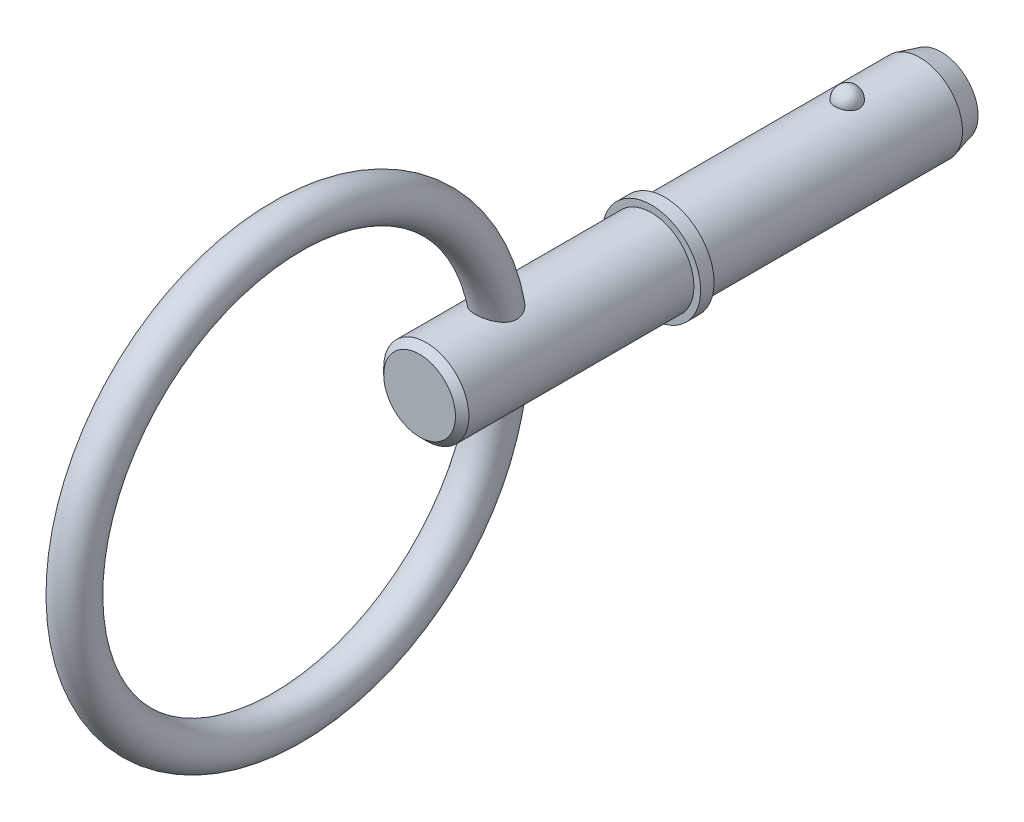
ISO-10303-21;
HEADER;
FILE_DESCRIPTION(('STEP AP214'),'2;1');
FILE_NAME('part.step','',(''),(''),'','','');
FILE_SCHEMA(('AUTOMOTIVE_DESIGN { 1 0 10303 214 1 1 1 1 }'));
ENDSEC;
DATA;
#1=APPLICATION_CONTEXT('core data for automotive mechanical design processes');
#2=APPLICATION_PROTOCOL_DEFINITION('international standard','automotive_design',2000,#1);
#3=PRODUCT_CONTEXT('',#1,'mechanical');
#4=PRODUCT('Part','Part','',(#3));
#5=PRODUCT_RELATED_PRODUCT_CATEGORY('part','',(#4));
#6=PRODUCT_DEFINITION_FORMATION('','',#4);
#7=PRODUCT_DEFINITION_CONTEXT('part definition',#1,'design');
#8=PRODUCT_DEFINITION('design','',#6,#7);
#9=PRODUCT_DEFINITION_SHAPE('','',#8);
#10=(LENGTH_UNIT() NAMED_UNIT(*) SI_UNIT(.MILLI.,.METRE.));
#11=(NAMED_UNIT(*) PLANE_ANGLE_UNIT() SI_UNIT($,.RADIAN.));
#12=(NAMED_UNIT(*) SI_UNIT($,.STERADIAN.) SOLID_ANGLE_UNIT());
#13=UNCERTAINTY_MEASURE_WITH_UNIT(LENGTH_MEASURE(1.E-05),#10,'distance_accuracy_value','');
#14=(GEOMETRIC_REPRESENTATION_CONTEXT(3) GLOBAL_UNCERTAINTY_ASSIGNED_CONTEXT((#13)) GLOBAL_UNIT_ASSIGNED_CONTEXT((#10,
#11,#12)) REPRESENTATION_CONTEXT('',''));
#15=CARTESIAN_POINT('',(0.,0.,0.));
#16=DIRECTION('',(0.,0.,1.));
#17=DIRECTION('',(1.,0.,0.));
#18=AXIS2_PLACEMENT_3D('',#15,#16,#17);
#19=CARTESIAN_POINT('',(0.,0.,12.7));
#20=DIRECTION('',(0.,0.,-1.));
#21=DIRECTION('',(-1.,0.,0.));
#22=AXIS2_PLACEMENT_3D('',#19,#20,#21);
#23=CYLINDRICAL_SURFACE('',#22,3.175);
#24=CARTESIAN_POINT('',(0.90060722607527,3.0445905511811,-0.910000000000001));
#25=CARTESIAN_POINT('',(0.90060646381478,3.04459122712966,-0.859144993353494));
#26=CARTESIAN_POINT('',(0.896466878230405,3.04582460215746,-0.808280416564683));
#27=CARTESIAN_POINT('',(0.88000740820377,3.05062019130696,-0.707994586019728));
#28=CARTESIAN_POINT('',(0.86768478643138,3.05418318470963,-0.658573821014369));
#29=CARTESIAN_POINT('',(0.835170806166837,3.06323316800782,-0.562604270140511));
#30=CARTESIAN_POINT('',(0.814982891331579,3.0687193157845,-0.516054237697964));
#31=CARTESIAN_POINT('',(0.767236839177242,3.08100268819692,-0.427093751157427));
#32=CARTESIAN_POINT('',(0.739678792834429,3.08779989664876,-0.384683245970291));
#33=CARTESIAN_POINT('',(0.677715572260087,3.10198953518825,-0.304951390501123));
#34=CARTESIAN_POINT('',(0.643275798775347,3.10938485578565,-0.267657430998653));
#35=CARTESIAN_POINT('',(0.568522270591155,3.12391647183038,-0.199446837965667));
#36=CARTESIAN_POINT('',(0.528208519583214,3.13105276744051,-0.168530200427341));
#37=CARTESIAN_POINT('',(0.442911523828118,3.14425008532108,-0.114021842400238));
#38=CARTESIAN_POINT('',(0.397942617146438,3.15031426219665,-0.0904084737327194));
#39=CARTESIAN_POINT('',(0.304493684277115,3.16071443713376,-0.051061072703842));
#40=CARTESIAN_POINT('',(0.256014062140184,3.1650506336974,-0.0353261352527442));
#41=CARTESIAN_POINT('',(0.15789136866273,3.17144549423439,-0.0124151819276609));
#42=CARTESIAN_POINT('',(0.108287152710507,3.1735453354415,-0.00508422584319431));
#43=CARTESIAN_POINT('',(0.0085070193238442,3.17538048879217,0.00133254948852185));
#44=CARTESIAN_POINT('',(-0.0416688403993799,3.17511603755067,0.000419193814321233));
#45=CARTESIAN_POINT('',(-0.140377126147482,3.17227395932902,-0.00954840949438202));
#46=CARTESIAN_POINT('',(-0.188922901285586,3.16973088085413,-0.0184810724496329));
#47=CARTESIAN_POINT('',(-0.283780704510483,3.16265029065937,-0.0440659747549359));
#48=CARTESIAN_POINT('',(-0.330092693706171,3.15811274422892,-0.0607183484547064));
#49=CARTESIAN_POINT('',(-0.419493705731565,3.1474895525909,-0.10140675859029));
#50=CARTESIAN_POINT('',(-0.462561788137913,3.14139480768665,-0.125486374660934));
#51=CARTESIAN_POINT('',(-0.54404237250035,3.12831396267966,-0.180346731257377));
#52=CARTESIAN_POINT('',(-0.582454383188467,3.12132776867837,-0.21112817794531));
#53=CARTESIAN_POINT('',(-0.654371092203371,3.10705591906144,-0.279257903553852));
#54=CARTESIAN_POINT('',(-0.687763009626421,3.09976707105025,-0.316724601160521));
#55=CARTESIAN_POINT('',(-0.747869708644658,3.08581767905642,-0.396782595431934));
#56=CARTESIAN_POINT('',(-0.774583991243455,3.07915718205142,-0.43937427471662));
#57=CARTESIAN_POINT('',(-0.820959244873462,3.06712152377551,-0.529074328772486));
#58=CARTESIAN_POINT('',(-0.840531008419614,3.06176288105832,-0.576231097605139));
#59=CARTESIAN_POINT('',(-0.871672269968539,3.0530437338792,-0.673291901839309));
#60=CARTESIAN_POINT('',(-0.883242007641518,3.04968316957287,-0.723195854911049));
#61=CARTESIAN_POINT('',(-0.898057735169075,3.04535343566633,-0.824104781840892));
#62=CARTESIAN_POINT('',(-0.901339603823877,3.04437395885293,-0.875104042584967));
#63=CARTESIAN_POINT('',(-0.89960137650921,3.04488803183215,-0.976947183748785));
#64=CARTESIAN_POINT('',(-0.894581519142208,3.04638151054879,-1.02779106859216));
#65=CARTESIAN_POINT('',(-0.876414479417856,3.051656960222,-1.12760218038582));
#66=CARTESIAN_POINT('',(-0.863310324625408,3.05542681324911,-1.17657789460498));
#67=CARTESIAN_POINT('',(-0.82933491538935,3.06482253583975,-1.27156757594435));
#68=CARTESIAN_POINT('',(-0.808463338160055,3.07044848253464,-1.31758141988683));
#69=CARTESIAN_POINT('',(-0.759325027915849,3.08296842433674,-1.40563218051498));
#70=CARTESIAN_POINT('',(-0.731017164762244,3.08986940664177,-1.44764515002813));
#71=CARTESIAN_POINT('',(-0.667767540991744,3.10415201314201,-1.52624913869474));
#72=CARTESIAN_POINT('',(-0.632825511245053,3.11153365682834,-1.56283993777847));
#73=CARTESIAN_POINT('',(-0.557049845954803,3.12598962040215,-1.62972906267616));
#74=CARTESIAN_POINT('',(-0.516193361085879,3.13306260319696,-1.66000181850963));
#75=CARTESIAN_POINT('',(-0.42979268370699,3.14607829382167,-1.7132172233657));
#76=CARTESIAN_POINT('',(-0.384248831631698,3.15202108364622,-1.73616040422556));
#77=CARTESIAN_POINT('',(-0.290370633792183,3.16204171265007,-1.77380927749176));
#78=CARTESIAN_POINT('',(-0.242079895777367,3.16614263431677,-1.7886174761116));
#79=CARTESIAN_POINT('',(-0.14357928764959,3.17213528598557,-1.81001390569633));
#80=CARTESIAN_POINT('',(-0.0933696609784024,3.1740272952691,-1.81660317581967));
#81=CARTESIAN_POINT('',(0.00648182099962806,3.17537830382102,-1.82132177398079));
#82=CARTESIAN_POINT('',(0.0561153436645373,3.17488455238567,-1.81961539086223));
#83=CARTESIAN_POINT('',(0.154368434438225,3.1716260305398,-1.80816900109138));
#84=CARTESIAN_POINT('',(0.202988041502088,3.16886134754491,-1.79842930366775));
#85=CARTESIAN_POINT('',(0.29764238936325,3.16137318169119,-1.77125024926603));
#86=CARTESIAN_POINT('',(0.343686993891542,3.15665785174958,-1.75384292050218));
#87=CARTESIAN_POINT('',(0.432167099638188,3.14576631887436,-1.71181408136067));
#88=CARTESIAN_POINT('',(0.474602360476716,3.13959001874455,-1.68719209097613));
#89=CARTESIAN_POINT('',(0.555408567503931,3.1263159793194,-1.63094218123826));
#90=CARTESIAN_POINT('',(0.593703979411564,3.11920512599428,-1.59920888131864));
#91=CARTESIAN_POINT('',(0.664472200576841,3.10490064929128,-1.52981493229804));
#92=CARTESIAN_POINT('',(0.696944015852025,3.09770701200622,-1.49215327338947));
#93=CARTESIAN_POINT('',(0.755798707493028,3.08388169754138,-1.41116434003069));
#94=CARTESIAN_POINT('',(0.782059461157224,3.07726269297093,-1.36774610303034));
#95=CARTESIAN_POINT('',(0.827051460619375,3.06547790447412,-1.27699966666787));
#96=CARTESIAN_POINT('',(0.845785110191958,3.06031165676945,-1.22967272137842));
#97=CARTESIAN_POINT('',(0.873798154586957,3.05242388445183,-1.13728658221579));
#98=CARTESIAN_POINT('',(0.883833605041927,3.04951005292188,-1.09247132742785));
#99=CARTESIAN_POINT('',(0.897238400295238,3.0455931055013,-1.00177329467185));
#100=CARTESIAN_POINT('',(0.900607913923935,3.0445899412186,-0.955890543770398));
#101=CARTESIAN_POINT('',(0.90060722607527,3.0445905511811,-0.910000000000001));
#102=B_SPLINE_CURVE_WITH_KNOTS('',3,(#24,#25,#26,#27,#28,#29,#30,#31,#32,#33,#34,#35,#36,#37,
#38,#39,#40,#41,#42,#43,#44,#45,#46,#47,#48,#49,#50,#51,#52,#53,#54,#55,#56,#57,#58,#59,#60,#61,
#62,#63,#64,#65,#66,#67,#68,#69,#70,#71,#72,#73,#74,#75,#76,#77,#78,#79,#80,#81,#82,#83,#84,#85,
#86,#87,#88,#89,#90,#91,#92,#93,#94,#95,#96,#97,#98,#99,#100,#101),.UNSPECIFIED.,.T.,.F.,(4,2,2,
2,2,2,2,2,2,2,2,2,2,2,2,2,2,2,2,2,2,2,2,2,2,2,2,2,2,2,2,2,2,2,2,2,2,2,4),(0.,0.152400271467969,
0.304851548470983,0.45723615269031,0.609618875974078,0.762787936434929,0.915956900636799,
1.06866739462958,1.22136034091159,1.37119044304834,1.52100555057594,1.66858689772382,
1.81617081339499,1.9646377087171,2.1131202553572,2.26455561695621,2.41600229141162,
2.5692805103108,2.72255413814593,2.87516308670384,3.02776764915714,3.1795669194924,
3.33137249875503,3.48403607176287,3.63670583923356,3.78998198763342,3.94324701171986,
4.09453370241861,4.24580126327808,4.39408543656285,4.5423639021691,4.69002878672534,
4.83770349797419,4.9877312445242,5.13778457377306,5.29058018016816,5.44332695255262,
5.58085340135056,5.71837636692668),.UNSPECIFIED.);
#103=CARTESIAN_POINT('',(0.90060722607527,3.0445905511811,-0.910000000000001));
#104=VERTEX_POINT('',#103);
#105=EDGE_CURVE('E100',#104,#104,#102,.T.);
#106=ORIENTED_EDGE('',*,*,#105,.T.);
#107=EDGE_LOOP('',(#106));
#108=FACE_BOUND('',#107,.T.);
#109=CARTESIAN_POINT('',(0.,0.,-6.33399999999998));
#110=DIRECTION('',(0.,0.,-1.));
#111=DIRECTION('',(-1.,0.,0.));
#112=AXIS2_PLACEMENT_3D('',#109,#110,#111);
#113=CIRCLE('',#112,3.175);
#114=CARTESIAN_POINT('',(-3.175,0.,-6.33399999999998));
#115=VERTEX_POINT('',#114);
#116=EDGE_CURVE('E108',#115,#115,#113,.F.);
#117=ORIENTED_EDGE('',*,*,#116,.T.);
#118=EDGE_LOOP('',(#117));
#119=FACE_BOUND('',#118,.T.);
#120=CARTESIAN_POINT('',(0.,0.,12.7));
#121=DIRECTION('',(0.,0.,1.));
#122=DIRECTION('',(1.,0.,0.));
#123=AXIS2_PLACEMENT_3D('',#120,#121,#122);
#124=CIRCLE('',#123,3.175);
#125=CARTESIAN_POINT('',(3.175,0.,12.7));
#126=VERTEX_POINT('',#125);
#127=EDGE_CURVE('E106',#126,#126,#124,.T.);
#128=ORIENTED_EDGE('',*,*,#127,.F.);
#129=EDGE_LOOP('',(#128));
#130=FACE_BOUND('',#129,.T.);
#131=ADVANCED_FACE('F39',(#108,#119,#130),#23,.T.);
#132=CARTESIAN_POINT('',(0.,0.,-7.92));
#133=DIRECTION('',(0.,0.,-1.));
#134=DIRECTION('',(-1.,0.,0.));
#135=AXIS2_PLACEMENT_3D('',#132,#133,#134);
#136=PLANE('',#135);
#137=CARTESIAN_POINT('',(0.,0.,-7.92));
#138=DIRECTION('',(0.,0.,-1.));
#139=DIRECTION('',(-1.,0.,0.));
#140=AXIS2_PLACEMENT_3D('',#137,#138,#139);
#141=CIRCLE('',#140,2.75003258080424);
#142=CARTESIAN_POINT('',(-2.75003258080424,0.,-7.92));
#143=VERTEX_POINT('',#142);
#144=EDGE_CURVE('E140',#143,#143,#141,.T.);
#145=ORIENTED_EDGE('',*,*,#144,.T.);
#146=EDGE_LOOP('',(#145));
#147=FACE_BOUND('',#146,.T.);
#148=ADVANCED_FACE('F86',(#147),#136,.T.);
#149=CARTESIAN_POINT('',(0.,0.,-7.92));
#150=DIRECTION('',(0.,0.,1.));
#151=DIRECTION('',(1.,0.,0.));
#152=AXIS2_PLACEMENT_3D('',#149,#150,#151);
#153=CONICAL_SURFACE('',#152,2.75003258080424,0.261799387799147);
#154=ORIENTED_EDGE('',*,*,#116,.F.);
#155=EDGE_LOOP('',(#154));
#156=FACE_BOUND('',#155,.T.);
#157=ORIENTED_EDGE('',*,*,#144,.F.);
#158=EDGE_LOOP('',(#157));
#159=FACE_BOUND('',#158,.T.);
#160=ADVANCED_FACE('F92',(#156,#159),#153,.T.);
#161=CARTESIAN_POINT('',(0.,3.175,-0.910000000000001));
#162=DIRECTION('',(0.,1.,0.));
#163=DIRECTION('',(0.,0.,-1.));
#164=AXIS2_PLACEMENT_3D('',#161,#162,#163);
#165=SPHERICAL_SURFACE('',#164,0.91);
#166=ORIENTED_EDGE('',*,*,#105,.F.);
#167=EDGE_LOOP('',(#166));
#168=FACE_BOUND('',#167,.T.);
#169=ADVANCED_FACE('F111',(#168),#165,.T.);
#170=CARTESIAN_POINT('',(0.,0.,12.7));
#171=DIRECTION('',(0.,0.,-1.));
#172=DIRECTION('',(-1.,0.,0.));
#173=AXIS2_PLACEMENT_3D('',#170,#171,#172);
#174=PLANE('',#173);
#175=ORIENTED_EDGE('',*,*,#127,.T.);
#176=EDGE_LOOP('',(#175));
#177=FACE_BOUND('',#176,.T.);
#178=CARTESIAN_POINT('',(0.,0.,12.7));
#179=DIRECTION('',(0.,0.,-1.));
#180=DIRECTION('',(-1.,0.,0.));
#181=AXIS2_PLACEMENT_3D('',#178,#179,#180);
#182=CIRCLE('',#181,3.675);
#183=CARTESIAN_POINT('',(-3.675,0.,12.7));
#184=VERTEX_POINT('',#183);
#185=EDGE_CURVE('E107',#184,#184,#182,.T.);
#186=ORIENTED_EDGE('',*,*,#185,.T.);
#187=EDGE_LOOP('',(#186));
#188=FACE_BOUND('',#187,.T.);
#189=ADVANCED_FACE('F115',(#177,#188),#174,.T.);
#190=CARTESIAN_POINT('',(0.,0.,33.7287874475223));
#191=DIRECTION('',(0.,0.,-1.));
#192=DIRECTION('',(-1.,0.,0.));
#193=AXIS2_PLACEMENT_3D('',#190,#191,#192);
#194=CYLINDRICAL_SURFACE('',#193,3.675);
#195=CARTESIAN_POINT('',(0.,0.,13.7));
#196=DIRECTION('',(0.,0.,-1.));
#197=DIRECTION('',(-1.,0.,0.));
#198=AXIS2_PLACEMENT_3D('',#195,#196,#197);
#199=CIRCLE('',#198,3.675);
#200=CARTESIAN_POINT('',(-3.675,0.,13.7));
#201=VERTEX_POINT('',#200);
#202=EDGE_CURVE('E132',#201,#201,#199,.T.);
#203=ORIENTED_EDGE('',*,*,#202,.T.);
#204=EDGE_LOOP('',(#203));
#205=FACE_BOUND('',#204,.T.);
#206=ORIENTED_EDGE('',*,*,#185,.F.);
#207=EDGE_LOOP('',(#206));
#208=FACE_BOUND('',#207,.T.);
#209=ADVANCED_FACE('F119',(#205,#208),#194,.T.);
#210=CARTESIAN_POINT('',(0.,3.675,13.7));
#211=DIRECTION('',(0.,0.,1.));
#212=DIRECTION('',(1.,0.,0.));
#213=AXIS2_PLACEMENT_3D('',#210,#211,#212);
#214=PLANE('',#213);
#215=CARTESIAN_POINT('',(0.,0.,13.7));
#216=DIRECTION('',(0.,0.,1.));
#217=DIRECTION('',(1.,0.,0.));
#218=AXIS2_PLACEMENT_3D('',#215,#216,#217);
#219=CIRCLE('',#218,3.175);
#220=CARTESIAN_POINT('',(3.175,0.,13.7));
#221=VERTEX_POINT('',#220);
#222=EDGE_CURVE('E110',#221,#221,#219,.T.);
#223=ORIENTED_EDGE('',*,*,#222,.F.);
#224=EDGE_LOOP('',(#223));
#225=FACE_BOUND('',#224,.T.);
#226=ORIENTED_EDGE('',*,*,#202,.F.);
#227=EDGE_LOOP('',(#226));
#228=FACE_BOUND('',#227,.T.);
#229=ADVANCED_FACE('F83',(#225,#228),#214,.T.);
#230=CARTESIAN_POINT('',(0.,0.,30.99));
#231=DIRECTION('',(0.,0.,-1.));
#232=DIRECTION('',(-1.,0.,0.));
#233=AXIS2_PLACEMENT_3D('',#230,#231,#232);
#234=CYLINDRICAL_SURFACE('',#233,3.175);
#235=CARTESIAN_POINT('',(-0.793622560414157,-3.07421343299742,23.9949618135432));
#236=CARTESIAN_POINT('',(-0.723928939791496,-3.09220199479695,23.9540743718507));
#237=CARTESIAN_POINT('',(-0.65053758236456,-3.10860299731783,23.9186572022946));
#238=CARTESIAN_POINT('',(-0.498225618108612,-3.13662262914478,23.85960803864));
#239=CARTESIAN_POINT('',(-0.419299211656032,-3.14823615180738,23.835988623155));
#240=CARTESIAN_POINT('',(-0.258022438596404,-3.16553731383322,23.8011787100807));
#241=CARTESIAN_POINT('',(-0.17566885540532,-3.17121924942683,23.7900001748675));
#242=CARTESIAN_POINT('',(-0.0100583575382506,-3.17606405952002,23.7804538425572));
#243=CARTESIAN_POINT('',(0.073198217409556,-3.17522930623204,23.7820813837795));
#244=CARTESIAN_POINT('',(0.236345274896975,-3.16722178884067,23.7979075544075));
#245=CARTESIAN_POINT('',(0.316269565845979,-3.16018772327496,23.8118310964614));
#246=CARTESIAN_POINT('',(0.472429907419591,-3.14064183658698,23.8514871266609));
#247=CARTESIAN_POINT('',(0.548665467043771,-3.12812928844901,23.8772211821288));
#248=CARTESIAN_POINT('',(0.696533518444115,-3.0985857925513,23.9403145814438));
#249=CARTESIAN_POINT('',(0.768085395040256,-3.08149328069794,23.9778336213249));
#250=CARTESIAN_POINT('',(0.903666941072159,-3.04449595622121,24.063584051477));
#251=CARTESIAN_POINT('',(0.967693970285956,-3.02459016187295,24.1118191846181));
#252=CARTESIAN_POINT('',(1.08889306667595,-2.98315111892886,24.2200855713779));
#253=CARTESIAN_POINT('',(1.14572430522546,-2.96158491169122,24.2804869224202));
#254=CARTESIAN_POINT('',(1.24806454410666,-2.91993487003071,24.4106874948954));
#255=CARTESIAN_POINT('',(1.29357550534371,-2.89985077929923,24.4804850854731));
#256=CARTESIAN_POINT('',(1.37094214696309,-2.86407549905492,24.6262600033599));
#257=CARTESIAN_POINT('',(1.40307792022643,-2.84829687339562,24.7020662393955));
#258=CARTESIAN_POINT('',(1.45397574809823,-2.82265933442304,24.8589553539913));
#259=CARTESIAN_POINT('',(1.47274938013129,-2.81279529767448,24.9400335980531));
#260=CARTESIAN_POINT('',(1.49549698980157,-2.80076108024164,25.0979026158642));
#261=CARTESIAN_POINT('',(1.50056337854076,-2.79802369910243,25.1744958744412));
#262=CARTESIAN_POINT('',(1.49933665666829,-2.79868066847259,25.3275541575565));
#263=CARTESIAN_POINT('',(1.49304097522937,-2.80207640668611,25.4040191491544));
#264=CARTESIAN_POINT('',(1.46976618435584,-2.81435249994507,25.5552802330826));
#265=CARTESIAN_POINT('',(1.45272287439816,-2.82326580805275,25.6300634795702));
#266=CARTESIAN_POINT('',(1.40884990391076,-2.84541139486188,25.7760088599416));
#267=CARTESIAN_POINT('',(1.38201642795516,-2.85864535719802,25.8471695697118));
#268=CARTESIAN_POINT('',(1.31496449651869,-2.89016475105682,25.9946079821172));
#269=CARTESIAN_POINT('',(1.27338339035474,-2.90890132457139,26.0701693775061));
#270=CARTESIAN_POINT('',(1.17952729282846,-2.94820796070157,26.2139034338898));
#271=CARTESIAN_POINT('',(1.12723913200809,-2.96878026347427,26.2820668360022));
#272=CARTESIAN_POINT('',(1.00570728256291,-3.01228109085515,26.4173106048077));
#273=CARTESIAN_POINT('',(0.935174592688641,-3.03519170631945,26.4832498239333));
#274=CARTESIAN_POINT('',(0.782605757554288,-3.07805054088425,26.6013215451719));
#275=CARTESIAN_POINT('',(0.700588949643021,-3.09800362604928,26.6534768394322));
#276=CARTESIAN_POINT('',(0.549003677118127,-3.12787153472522,26.7296423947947));
#277=CARTESIAN_POINT('',(0.481582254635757,-3.1390487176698,26.7574376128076));
#278=CARTESIAN_POINT('',(0.342696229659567,-3.15722518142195,26.8021563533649));
#279=CARTESIAN_POINT('',(0.271235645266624,-3.16422853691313,26.8190904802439));
#280=CARTESIAN_POINT('',(0.12587380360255,-3.17334230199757,26.8410622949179));
#281=CARTESIAN_POINT('',(0.0519637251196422,-3.17543249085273,26.8460508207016));
#282=CARTESIAN_POINT('',(-0.0956207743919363,-3.17441743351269,26.8436180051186));
#283=CARTESIAN_POINT('',(-0.169295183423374,-3.1713119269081,26.8361960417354));
#284=CARTESIAN_POINT('',(-0.309449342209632,-3.16061694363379,26.8103375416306));
#285=CARTESIAN_POINT('',(-0.376089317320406,-3.15332372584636,26.7926279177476));
#286=CARTESIAN_POINT('',(-0.505583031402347,-3.13517004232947,26.7477876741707));
#287=CARTESIAN_POINT('',(-0.568435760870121,-3.12430863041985,26.7206545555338));
#288=CARTESIAN_POINT('',(-0.694306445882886,-3.09887452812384,26.6555626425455));
#289=CARTESIAN_POINT('',(-0.756907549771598,-3.08406907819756,26.6168937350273));
#290=CARTESIAN_POINT('',(-0.875645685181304,-3.05248288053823,26.5313455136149));
#291=CARTESIAN_POINT('',(-0.931779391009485,-3.03570112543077,26.4844620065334));
#292=CARTESIAN_POINT('',(-1.0463923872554,-2.99832170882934,26.3747926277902));
#293=CARTESIAN_POINT('',(-1.10353654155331,-2.97757338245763,26.3106605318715));
#294=CARTESIAN_POINT('',(-1.20755858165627,-2.93692907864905,26.1742268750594));
#295=CARTESIAN_POINT('',(-1.25442453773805,-2.91703411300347,26.1019159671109));
#296=CARTESIAN_POINT('',(-1.34199791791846,-2.87788786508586,25.9412794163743));
#297=CARTESIAN_POINT('',(-1.38127718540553,-2.8590047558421,25.8520744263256));
#298=CARTESIAN_POINT('',(-1.44406659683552,-2.82781619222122,25.6671839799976));
#299=CARTESIAN_POINT('',(-1.46759319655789,-2.81550387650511,25.5715054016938));
#300=CARTESIAN_POINT('',(-1.49571801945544,-2.8006591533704,25.3845771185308));
#301=CARTESIAN_POINT('',(-1.50169726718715,-2.79741422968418,25.293598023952));
#302=CARTESIAN_POINT('',(-1.49747735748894,-2.79967890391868,25.1121564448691));
#303=CARTESIAN_POINT('',(-1.48729863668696,-2.80517744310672,25.0216934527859));
#304=CARTESIAN_POINT('',(-1.45348639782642,-2.82281521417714,24.8584626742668));
#305=CARTESIAN_POINT('',(-1.43212237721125,-2.83382344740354,24.785088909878));
#306=CARTESIAN_POINT('',(-1.37828411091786,-2.86039426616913,24.6433903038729));
#307=CARTESIAN_POINT('',(-1.34580440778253,-2.87595908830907,24.5750679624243));
#308=CARTESIAN_POINT('',(-1.27066760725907,-2.90993532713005,24.4450336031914));
#309=CARTESIAN_POINT('',(-1.22800357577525,-2.92834868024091,24.383326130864));
#310=CARTESIAN_POINT('',(-1.13363307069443,-2.96615489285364,24.2677083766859));
#311=CARTESIAN_POINT('',(-1.08193541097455,-2.98554678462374,24.2137905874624));
#312=CARTESIAN_POINT('',(-0.990573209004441,-3.01675653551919,24.1323094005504));
#313=CARTESIAN_POINT('',(-0.953209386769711,-3.02880489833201,24.1022130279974));
#314=CARTESIAN_POINT('',(-0.875544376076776,-3.05216210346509,24.0457477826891));
#315=CARTESIAN_POINT('',(-0.835242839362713,-3.06347085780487,24.0193793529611));
#316=CARTESIAN_POINT('',(-0.793622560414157,-3.07421343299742,23.9949618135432));
#317=B_SPLINE_CURVE_WITH_KNOTS('',3,(#235,#236,#237,#238,#239,#240,#241,#242,#243,#244,#245,
#246,#247,#248,#249,#250,#251,#252,#253,#254,#255,#256,#257,#258,#259,#260,#261,#262,#263,#264,
#265,#266,#267,#268,#269,#270,#271,#272,#273,#274,#275,#276,#277,#278,#279,#280,#281,#282,#283,
#284,#285,#286,#287,#288,#289,#290,#291,#292,#293,#294,#295,#296,#297,#298,#299,#300,#301,#302,
#303,#304,#305,#306,#307,#308,#309,#310,#311,#312,#313,#314,#315,#316),.UNSPECIFIED.,.T.,.F.,(4,
2,2,2,2,2,2,2,2,2,2,2,2,2,2,2,2,2,2,2,2,2,2,2,2,2,2,2,2,2,2,2,2,2,2,2,2,2,2,2,4),(0.,
0.24816752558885,0.496599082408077,0.745269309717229,0.993849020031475,1.23700449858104,
1.48019225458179,1.72682894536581,1.97355191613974,2.22939388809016,2.48519151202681,
2.73532416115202,2.98523982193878,3.2145541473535,3.4439203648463,3.67466984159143,
3.90550934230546,4.16925064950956,4.43331832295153,4.72951976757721,5.02522832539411,
5.24564983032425,5.46585579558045,5.68696647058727,5.90808822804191,6.11521387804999,
6.32239449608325,6.54672206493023,6.77116447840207,7.03522663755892,7.29959368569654,
7.5959009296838,7.89189815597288,8.16387683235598,8.43551178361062,8.66603557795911,
8.89667271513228,9.12746733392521,9.35803801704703,9.50622339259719,9.6544263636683),.UNSPECIFIED.);
#318=CARTESIAN_POINT('',(-0.793622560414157,-3.07421343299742,23.9949618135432));
#319=VERTEX_POINT('',#318);
#320=EDGE_CURVE('E10',#319,#319,#317,.T.);
#321=ORIENTED_EDGE('',*,*,#320,.F.);
#322=EDGE_LOOP('',(#321));
#323=FACE_BOUND('',#322,.T.);
#324=CARTESIAN_POINT('',(-0.793622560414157,3.07421343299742,23.9949618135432));
#325=CARTESIAN_POINT('',(-0.864606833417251,3.05588589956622,24.0366128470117));
#326=CARTESIAN_POINT('',(-0.931875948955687,3.03587991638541,24.0840114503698));
#327=CARTESIAN_POINT('',(-1.05725170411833,2.99453227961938,24.1893775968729));
#328=CARTESIAN_POINT('',(-1.11534118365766,2.97318822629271,24.2473645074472));
#329=CARTESIAN_POINT('',(-1.22080462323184,2.93146441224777,24.372887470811));
#330=CARTESIAN_POINT('',(-1.26816209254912,2.91108617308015,24.4404379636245));
#331=CARTESIAN_POINT('',(-1.35052787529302,2.87380473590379,24.5835086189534));
#332=CARTESIAN_POINT('',(-1.38554886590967,2.856897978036,24.6590204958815));
#333=CARTESIAN_POINT('',(-1.44074287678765,2.82945202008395,24.8122947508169));
#334=CARTESIAN_POINT('',(-1.46153301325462,2.81865228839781,24.8897872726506));
#335=CARTESIAN_POINT('',(-1.49023441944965,2.80358650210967,25.0477206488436));
#336=CARTESIAN_POINT('',(-1.49815016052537,2.79931817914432,25.1281604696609));
#337=CARTESIAN_POINT('',(-1.50117056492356,2.79769676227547,25.2840076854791));
#338=CARTESIAN_POINT('',(-1.49708260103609,2.79990784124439,25.3593985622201));
#339=CARTESIAN_POINT('',(-1.47846985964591,2.80977909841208,25.5084983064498));
#340=CARTESIAN_POINT('',(-1.46394166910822,2.8174410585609,25.5822066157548));
#341=CARTESIAN_POINT('',(-1.42400377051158,2.83784609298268,25.7313443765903));
#342=CARTESIAN_POINT('',(-1.39791960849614,2.85090002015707,25.8065484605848));
#343=CARTESIAN_POINT('',(-1.33585690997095,2.8805017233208,25.9520384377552));
#344=CARTESIAN_POINT('',(-1.29987052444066,2.89705226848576,26.0223203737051));
#345=CARTESIAN_POINT('',(-1.21229019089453,2.93489412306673,26.1677405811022));
#346=CARTESIAN_POINT('',(-1.15911759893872,2.95651988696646,26.2418449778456));
#347=CARTESIAN_POINT('',(-1.04143166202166,2.99999612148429,26.3803805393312));
#348=CARTESIAN_POINT('',(-0.976918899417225,3.0218465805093,26.444812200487));
#349=CARTESIAN_POINT('',(-0.845368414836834,3.06106710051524,26.5552302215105));
#350=CARTESIAN_POINT('',(-0.779466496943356,3.0786636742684,26.6024840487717));
#351=CARTESIAN_POINT('',(-0.640261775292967,3.11059085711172,26.6859540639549));
#352=CARTESIAN_POINT('',(-0.56696394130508,3.12492363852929,26.7221775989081));
#353=CARTESIAN_POINT('',(-0.413802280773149,3.14887886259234,26.7818109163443));
#354=CARTESIAN_POINT('',(-0.333888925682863,3.15846114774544,26.8051116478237));
#355=CARTESIAN_POINT('',(-0.170660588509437,3.17146222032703,26.8365717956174));
#356=CARTESIAN_POINT('',(-0.0873493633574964,3.17488763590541,26.8447474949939));
#357=CARTESIAN_POINT('',(0.0674621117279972,3.17509166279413,26.8452317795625));
#358=CARTESIAN_POINT('',(0.138963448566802,3.17274321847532,26.8396242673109));
#359=CARTESIAN_POINT('',(0.279855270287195,3.16342998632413,26.8171581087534));
#360=CARTESIAN_POINT('',(0.349245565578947,3.15646478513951,26.8002984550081));
#361=CARTESIAN_POINT('',(0.483013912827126,3.13875920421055,26.7567119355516));
#362=CARTESIAN_POINT('',(0.547455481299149,3.12808257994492,26.7301513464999));
#363=CARTESIAN_POINT('',(0.671431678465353,3.10383639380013,26.6683782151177));
#364=CARTESIAN_POINT('',(0.730964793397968,3.09026594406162,26.6331630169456));
#365=CARTESIAN_POINT('',(0.852308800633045,3.05919023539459,26.5498716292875));
#366=CARTESIAN_POINT('',(0.913284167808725,3.04140021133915,26.5006877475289));
#367=CARTESIAN_POINT('',(1.0273242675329,3.00480015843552,26.3941850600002));
#368=CARTESIAN_POINT('',(1.08038247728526,2.98598930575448,26.3368596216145));
#369=CARTESIAN_POINT('',(1.18657794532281,2.94557646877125,26.2046952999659));
#370=CARTESIAN_POINT('',(1.23812372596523,2.92405810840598,26.1285445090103));
#371=CARTESIAN_POINT('',(1.32862928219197,2.88406370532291,25.9682796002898));
#372=CARTESIAN_POINT('',(1.36758013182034,2.86558982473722,25.8841598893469));
#373=CARTESIAN_POINT('',(1.43274280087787,2.83359383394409,25.7061421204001));
#374=CARTESIAN_POINT('',(1.45837682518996,2.82030175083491,25.6119863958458));
#375=CARTESIAN_POINT('',(1.49241322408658,2.80245006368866,25.4198495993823));
#376=CARTESIAN_POINT('',(1.50084951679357,2.79787327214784,25.3218764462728));
#377=CARTESIAN_POINT('',(1.49914798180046,2.79877932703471,25.1405073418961));
#378=CARTESIAN_POINT('',(1.49154990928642,2.80288682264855,25.057078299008));
#379=CARTESIAN_POINT('',(1.4625313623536,2.81813655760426,24.8933228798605));
#380=CARTESIAN_POINT('',(1.44111368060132,2.82927737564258,24.8129958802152));
#381=CARTESIAN_POINT('',(1.38785163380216,2.85574398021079,24.6657200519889));
#382=CARTESIAN_POINT('',(1.3572264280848,2.87055627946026,24.5982302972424));
#383=CARTESIAN_POINT('',(1.28612163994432,2.90310901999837,24.4694446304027));
#384=CARTESIAN_POINT('',(1.24564038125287,2.92084995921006,24.408149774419));
#385=CARTESIAN_POINT('',(1.1532082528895,2.95860856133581,24.2894756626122));
#386=CARTESIAN_POINT('',(1.10072548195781,2.97869868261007,24.2325343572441));
#387=CARTESIAN_POINT('',(0.987118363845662,3.01825121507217,24.1277702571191));
#388=CARTESIAN_POINT('',(0.925990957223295,3.03771340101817,24.0799507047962));
#389=CARTESIAN_POINT('',(0.79206515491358,3.07545294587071,23.9913571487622));
#390=CARTESIAN_POINT('',(0.718757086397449,3.0935612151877,23.9512781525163));
#391=CARTESIAN_POINT('',(0.565747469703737,3.12516438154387,23.8833730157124));
#392=CARTESIAN_POINT('',(0.486046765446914,3.13865988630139,23.8555452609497));
#393=CARTESIAN_POINT('',(0.323293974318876,3.15955163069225,23.8130890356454));
#394=CARTESIAN_POINT('',(0.240283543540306,3.16700771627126,23.7983309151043));
#395=CARTESIAN_POINT('',(0.0726303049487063,3.17527774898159,23.7819853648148));
#396=CARTESIAN_POINT('',(-0.0120126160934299,3.17609123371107,23.7803988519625));
#397=CARTESIAN_POINT('',(-0.177340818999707,3.17108555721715,23.7902649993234));
#398=CARTESIAN_POINT('',(-0.258061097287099,3.16549698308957,23.8012643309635));
#399=CARTESIAN_POINT('',(-0.416230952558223,3.1486007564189,23.8352506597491));
#400=CARTESIAN_POINT('',(-0.493684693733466,3.13730063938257,23.8582218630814));
#401=CARTESIAN_POINT('',(-0.607599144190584,3.11657538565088,23.9018364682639));
#402=CARTESIAN_POINT('',(-0.645999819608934,3.10882447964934,23.9183691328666));
#403=CARTESIAN_POINT('',(-0.721122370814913,3.092262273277,23.9544352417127));
#404=CARTESIAN_POINT('',(-0.757844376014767,3.08345105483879,23.9739684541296));
#405=CARTESIAN_POINT('',(-0.793622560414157,3.07421343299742,23.9949618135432));
#406=B_SPLINE_CURVE_WITH_KNOTS('',3,(#324,#325,#326,#327,#328,#329,#330,#331,#332,#333,#334,
#335,#336,#337,#338,#339,#340,#341,#342,#343,#344,#345,#346,#347,#348,#349,#350,#351,#352,#353,
#354,#355,#356,#357,#358,#359,#360,#361,#362,#363,#364,#365,#366,#367,#368,#369,#370,#371,#372,
#373,#374,#375,#376,#377,#378,#379,#380,#381,#382,#383,#384,#385,#386,#387,#388,#389,#390,#391,
#392,#393,#394,#395,#396,#397,#398,#399,#400,#401,#402,#403,#404,#405),.UNSPECIFIED.,.T.,.F.,(4,
2,2,2,2,2,2,2,2,2,2,2,2,2,2,2,2,2,2,2,2,2,2,2,2,2,2,2,2,2,2,2,2,2,2,2,2,2,2,2,4),(0.,
0.252800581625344,0.506068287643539,0.759722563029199,1.01311541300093,1.25467278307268,
1.49614624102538,1.7217579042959,1.94744335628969,2.18851823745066,2.42978476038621,
2.7098131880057,2.98982723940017,3.23776482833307,3.48553690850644,3.73536921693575,
3.98493240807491,4.19913817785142,4.4133631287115,4.62407643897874,4.83485449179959,
5.07495869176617,5.31525962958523,5.59735778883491,5.87965543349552,6.17335015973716,
6.46646508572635,6.71664398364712,6.96677234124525,7.19253107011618,7.41832822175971,
7.6573166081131,7.89638978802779,8.15162793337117,8.40683243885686,8.65947601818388,
8.91213718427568,9.15597668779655,9.39949531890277,9.5269241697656,9.65434318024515),.UNSPECIFIED.);
#407=CARTESIAN_POINT('',(-0.793622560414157,3.07421343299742,23.9949618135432));
#408=VERTEX_POINT('',#407);
#409=EDGE_CURVE('E51',#408,#408,#406,.T.);
#410=ORIENTED_EDGE('',*,*,#409,.F.);
#411=EDGE_LOOP('',(#410));
#412=FACE_BOUND('',#411,.T.);
#413=CARTESIAN_POINT('',(0.,0.,30.49));
#414=DIRECTION('',(0.,0.,-1.));
#415=DIRECTION('',(-1.,0.,0.));
#416=AXIS2_PLACEMENT_3D('',#413,#414,#415);
#417=CIRCLE('',#416,3.175);
#418=CARTESIAN_POINT('',(-3.175,0.,30.49));
#419=VERTEX_POINT('',#418);
#420=EDGE_CURVE('E62',#419,#419,#417,.T.);
#421=ORIENTED_EDGE('',*,*,#420,.T.);
#422=EDGE_LOOP('',(#421));
#423=FACE_BOUND('',#422,.T.);
#424=ORIENTED_EDGE('',*,*,#222,.T.);
#425=EDGE_LOOP('',(#424));
#426=FACE_BOUND('',#425,.T.);
#427=ADVANCED_FACE('F67',(#323,#412,#423,#426),#234,.T.);
#428=CARTESIAN_POINT('',(0.,0.,30.99));
#429=DIRECTION('',(0.,0.,-1.));
#430=DIRECTION('',(-1.,0.,0.));
#431=AXIS2_PLACEMENT_3D('',#428,#429,#430);
#432=PLANE('',#431);
#433=CARTESIAN_POINT('',(0.,0.,30.99));
#434=DIRECTION('',(0.,0.,-1.));
#435=DIRECTION('',(-1.,0.,0.));
#436=AXIS2_PLACEMENT_3D('',#433,#434,#435);
#437=CIRCLE('',#436,2.675);
#438=CARTESIAN_POINT('',(-2.675,0.,30.99));
#439=VERTEX_POINT('',#438);
#440=EDGE_CURVE('E57',#439,#439,#437,.F.);
#441=ORIENTED_EDGE('',*,*,#440,.T.);
#442=EDGE_LOOP('',(#441));
#443=FACE_BOUND('',#442,.T.);
#444=ADVANCED_FACE('F74',(#443),#432,.F.);
#445=CARTESIAN_POINT('',(0.,0.,30.49));
#446=DIRECTION('',(0.,0.,-1.));
#447=DIRECTION('',(-1.,0.,0.));
#448=AXIS2_PLACEMENT_3D('',#445,#446,#447);
#449=CONICAL_SURFACE('',#448,3.175,0.785398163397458);
#450=ORIENTED_EDGE('',*,*,#440,.F.);
#451=EDGE_LOOP('',(#450));
#452=FACE_BOUND('',#451,.T.);
#453=ORIENTED_EDGE('',*,*,#420,.F.);
#454=EDGE_LOOP('',(#453));
#455=FACE_BOUND('',#454,.T.);
#456=ADVANCED_FACE('F41',(#452,#455),#449,.T.);
#457=CARTESIAN_POINT('',(0.,0.,40.865));
#458=DIRECTION('',(1.,0.,0.));
#459=DIRECTION('',(0.,0.,-1.));
#460=AXIS2_PLACEMENT_3D('',#457,#458,#459);
#461=TOROIDAL_SURFACE('',#460,15.875,1.5);
#462=ORIENTED_EDGE('',*,*,#320,.T.);
#463=EDGE_LOOP('',(#462));
#464=FACE_BOUND('',#463,.T.);
#465=ORIENTED_EDGE('',*,*,#409,.T.);
#466=EDGE_LOOP('',(#465));
#467=FACE_BOUND('',#466,.T.);
#468=ADVANCED_FACE('F71',(#464,#467),#461,.T.);
#469=CLOSED_SHELL('',(#131,#148,#160,#169,#189,#209,#229,#427,#444,#456,#468));
#470=MANIFOLD_SOLID_BREP('B2',#469);
#471=ADVANCED_BREP_SHAPE_REPRESENTATION('',(#18,#470),#14);
#472=SHAPE_DEFINITION_REPRESENTATION(#9,#471);
ENDSEC;
END-ISO-10303-21;
